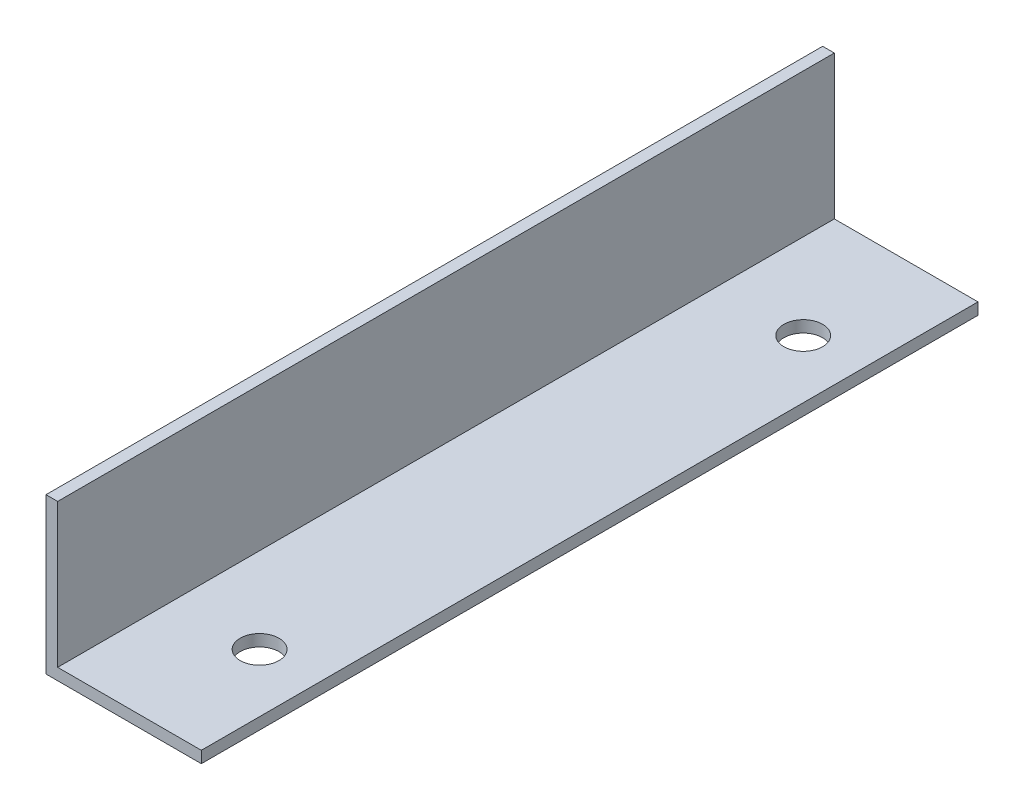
from build123d import *

# Parameters (mm, degrees)
EXTRUSION1_DEPTH        = 200
ESQUISSE2_R             = 5
ENL_V_MAT_EXTRU_1_DEPTH = 208.289652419


with BuildPart() as part:
    # Esquisse1 → Extrusion1 (new body)
    with BuildSketch(Plane.XY):
        Polygon((0, 0), (0, 40), (3, 40), (3, 3), (40, 3), (40, 0), align=None)
    extrude(amount=EXTRUSION1_DEPTH)

    # Esquisse2 → Enl_v. mat.-Extru.1 (cut, through all)
    with BuildSketch(Plane(origin=(0, 3, 0), x_dir=(-1, 0, 0), z_dir=(0, 1, 0))):
        with Locations(Location((-25, 170, 0), (0, 0, 90))):
            Circle(ESQUISSE2_R)
        with Locations(Location((-25, 30, 0), (0, 0, 90))):
            Circle(ESQUISSE2_R)
    extrude(amount=-ENL_V_MAT_EXTRU_1_DEPTH, mode=Mode.SUBTRACT)


solid = part.part
